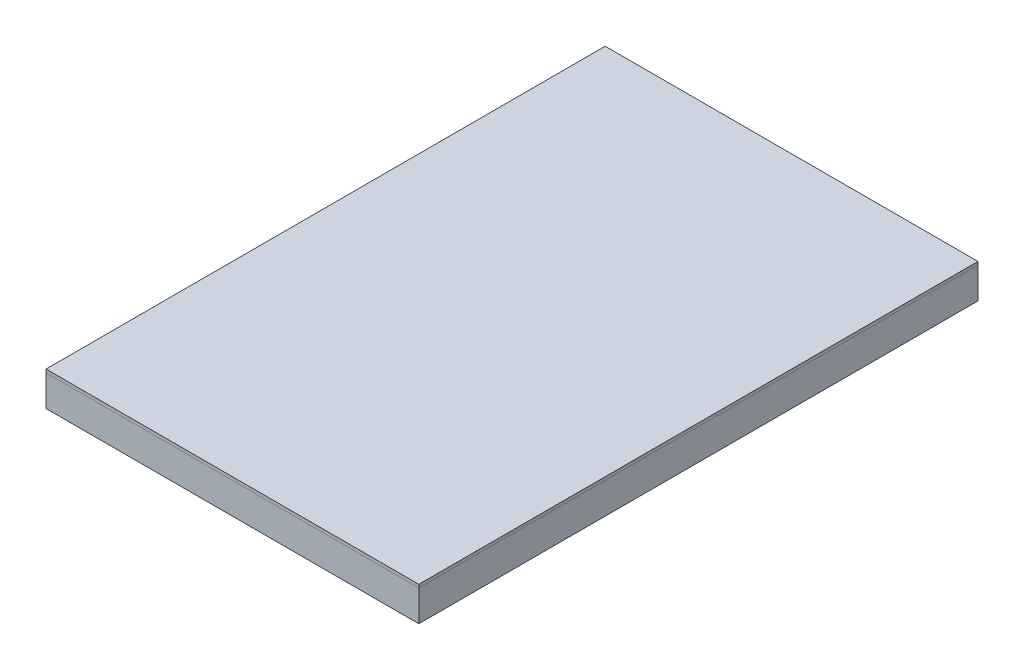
ISO-10303-21;
HEADER;
FILE_DESCRIPTION(('STEP AP214'),'2;1');
FILE_NAME('part.step','',(''),(''),'','','');
FILE_SCHEMA(('AUTOMOTIVE_DESIGN { 1 0 10303 214 1 1 1 1 }'));
ENDSEC;
DATA;
#1=APPLICATION_CONTEXT('core data for automotive mechanical design processes');
#2=APPLICATION_PROTOCOL_DEFINITION('international standard','automotive_design',2000,#1);
#3=PRODUCT_CONTEXT('',#1,'mechanical');
#4=PRODUCT('Part','Part','',(#3));
#5=PRODUCT_RELATED_PRODUCT_CATEGORY('part','',(#4));
#6=PRODUCT_DEFINITION_FORMATION('','',#4);
#7=PRODUCT_DEFINITION_CONTEXT('part definition',#1,'design');
#8=PRODUCT_DEFINITION('design','',#6,#7);
#9=PRODUCT_DEFINITION_SHAPE('','',#8);
#10=(LENGTH_UNIT() NAMED_UNIT(*) SI_UNIT(.MILLI.,.METRE.));
#11=(NAMED_UNIT(*) PLANE_ANGLE_UNIT() SI_UNIT($,.RADIAN.));
#12=(NAMED_UNIT(*) SI_UNIT($,.STERADIAN.) SOLID_ANGLE_UNIT());
#13=UNCERTAINTY_MEASURE_WITH_UNIT(LENGTH_MEASURE(1.E-05),#10,'distance_accuracy_value','');
#14=(GEOMETRIC_REPRESENTATION_CONTEXT(3) GLOBAL_UNCERTAINTY_ASSIGNED_CONTEXT((#13)) GLOBAL_UNIT_ASSIGNED_CONTEXT((#10,
#11,#12)) REPRESENTATION_CONTEXT('',''));
#15=CARTESIAN_POINT('',(0.,0.,0.));
#16=DIRECTION('',(0.,0.,1.));
#17=DIRECTION('',(1.,0.,0.));
#18=AXIS2_PLACEMENT_3D('',#15,#16,#17);
#19=CARTESIAN_POINT('',(-152.4,-25.4,-228.6));
#20=DIRECTION('',(-1.,0.,0.));
#21=DIRECTION('',(0.,0.,1.));
#22=AXIS2_PLACEMENT_3D('',#19,#20,#21);
#23=PLANE('',#22);
#24=DIRECTION('',(0.,0.,1.));
#25=VECTOR('',#24,1.);
#26=CARTESIAN_POINT('',(-152.4,0.,-228.6));
#27=LINE('',#26,#25);
#28=CARTESIAN_POINT('',(-152.4,0.,-228.6));
#29=VERTEX_POINT('',#28);
#30=CARTESIAN_POINT('',(-152.4,0.,228.6));
#31=VERTEX_POINT('',#30);
#32=EDGE_CURVE('E163',#29,#31,#27,.T.);
#33=ORIENTED_EDGE('',*,*,#32,.F.);
#34=DIRECTION('',(0.,1.,0.));
#35=VECTOR('',#34,1.);
#36=CARTESIAN_POINT('',(-152.4,-25.4,-228.6));
#37=LINE('',#36,#35);
#38=CARTESIAN_POINT('',(-152.4,-25.4,-228.6));
#39=VERTEX_POINT('',#38);
#40=EDGE_CURVE('E13',#39,#29,#37,.T.);
#41=ORIENTED_EDGE('',*,*,#40,.F.);
#42=DIRECTION('',(0.,0.,1.));
#43=VECTOR('',#42,1.);
#44=CARTESIAN_POINT('',(-152.4,-25.4,-228.6));
#45=LINE('',#44,#43);
#46=CARTESIAN_POINT('',(-152.4,-25.4,228.6));
#47=VERTEX_POINT('',#46);
#48=EDGE_CURVE('E167',#39,#47,#45,.T.);
#49=ORIENTED_EDGE('',*,*,#48,.T.);
#50=DIRECTION('',(0.,1.,0.));
#51=VECTOR('',#50,1.);
#52=CARTESIAN_POINT('',(-152.4,-25.4,228.6));
#53=LINE('',#52,#51);
#54=EDGE_CURVE('E68',#47,#31,#53,.T.);
#55=ORIENTED_EDGE('',*,*,#54,.T.);
#56=EDGE_LOOP('',(#33,#41,#49,#55));
#57=FACE_BOUND('',#56,.T.);
#58=ADVANCED_FACE('F65',(#57),#23,.T.);
#59=CARTESIAN_POINT('',(-152.4,-25.4,-228.6));
#60=DIRECTION('',(0.,0.,-1.));
#61=DIRECTION('',(-1.,0.,0.));
#62=AXIS2_PLACEMENT_3D('',#59,#60,#61);
#63=PLANE('',#62);
#64=DIRECTION('',(-1.,0.,0.));
#65=VECTOR('',#64,1.);
#66=CARTESIAN_POINT('',(-152.4,0.,-228.6));
#67=LINE('',#66,#65);
#68=CARTESIAN_POINT('',(152.4,0.,-228.6));
#69=VERTEX_POINT('',#68);
#70=EDGE_CURVE('E171',#69,#29,#67,.T.);
#71=ORIENTED_EDGE('',*,*,#70,.F.);
#72=DIRECTION('',(0.,1.,0.));
#73=VECTOR('',#72,1.);
#74=CARTESIAN_POINT('',(152.4,-25.4,-228.6));
#75=LINE('',#74,#73);
#76=CARTESIAN_POINT('',(152.4,-25.4,-228.6));
#77=VERTEX_POINT('',#76);
#78=EDGE_CURVE('E73',#77,#69,#75,.T.);
#79=ORIENTED_EDGE('',*,*,#78,.F.);
#80=DIRECTION('',(-1.,0.,0.));
#81=VECTOR('',#80,1.);
#82=CARTESIAN_POINT('',(-152.4,-25.4,-228.6));
#83=LINE('',#82,#81);
#84=EDGE_CURVE('E177',#77,#39,#83,.T.);
#85=ORIENTED_EDGE('',*,*,#84,.T.);
#86=ORIENTED_EDGE('',*,*,#40,.T.);
#87=EDGE_LOOP('',(#71,#79,#85,#86));
#88=FACE_BOUND('',#87,.T.);
#89=ADVANCED_FACE('F203',(#88),#63,.T.);
#90=CARTESIAN_POINT('',(152.4,-25.4,-228.6));
#91=DIRECTION('',(1.,0.,0.));
#92=DIRECTION('',(0.,0.,-1.));
#93=AXIS2_PLACEMENT_3D('',#90,#91,#92);
#94=PLANE('',#93);
#95=DIRECTION('',(0.,0.,-1.));
#96=VECTOR('',#95,1.);
#97=CARTESIAN_POINT('',(152.4,0.,-228.6));
#98=LINE('',#97,#96);
#99=CARTESIAN_POINT('',(152.4,0.,228.6));
#100=VERTEX_POINT('',#99);
#101=EDGE_CURVE('E185',#100,#69,#98,.T.);
#102=ORIENTED_EDGE('',*,*,#101,.F.);
#103=DIRECTION('',(0.,1.,0.));
#104=VECTOR('',#103,1.);
#105=CARTESIAN_POINT('',(152.4,-25.4,228.6));
#106=LINE('',#105,#104);
#107=CARTESIAN_POINT('',(152.4,-25.4,228.6));
#108=VERTEX_POINT('',#107);
#109=EDGE_CURVE('E190',#108,#100,#106,.T.);
#110=ORIENTED_EDGE('',*,*,#109,.F.);
#111=DIRECTION('',(0.,0.,-1.));
#112=VECTOR('',#111,1.);
#113=CARTESIAN_POINT('',(152.4,-25.4,-228.6));
#114=LINE('',#113,#112);
#115=EDGE_CURVE('E174',#108,#77,#114,.T.);
#116=ORIENTED_EDGE('',*,*,#115,.T.);
#117=ORIENTED_EDGE('',*,*,#78,.T.);
#118=EDGE_LOOP('',(#102,#110,#116,#117));
#119=FACE_BOUND('',#118,.T.);
#120=ADVANCED_FACE('F207',(#119),#94,.T.);
#121=CARTESIAN_POINT('',(-152.4,-25.4,228.6));
#122=DIRECTION('',(0.,0.,1.));
#123=DIRECTION('',(1.,0.,0.));
#124=AXIS2_PLACEMENT_3D('',#121,#122,#123);
#125=PLANE('',#124);
#126=DIRECTION('',(1.,0.,0.));
#127=VECTOR('',#126,1.);
#128=CARTESIAN_POINT('',(-152.4,0.,228.6));
#129=LINE('',#128,#127);
#130=EDGE_CURVE('E182',#31,#100,#129,.T.);
#131=ORIENTED_EDGE('',*,*,#130,.F.);
#132=ORIENTED_EDGE('',*,*,#54,.F.);
#133=DIRECTION('',(1.,0.,0.));
#134=VECTOR('',#133,1.);
#135=CARTESIAN_POINT('',(-152.4,-25.4,228.6));
#136=LINE('',#135,#134);
#137=EDGE_CURVE('E170',#47,#108,#136,.T.);
#138=ORIENTED_EDGE('',*,*,#137,.T.);
#139=ORIENTED_EDGE('',*,*,#109,.T.);
#140=EDGE_LOOP('',(#131,#132,#138,#139));
#141=FACE_BOUND('',#140,.T.);
#142=ADVANCED_FACE('F198',(#141),#125,.T.);
#143=CARTESIAN_POINT('',(-152.4,-25.4,228.6));
#144=DIRECTION('',(0.,1.,0.));
#145=DIRECTION('',(0.,0.,1.));
#146=AXIS2_PLACEMENT_3D('',#143,#144,#145);
#147=PLANE('',#146);
#148=DIRECTION('',(-1.,0.,0.));
#149=VECTOR('',#148,1.);
#150=CARTESIAN_POINT('',(-152.4,-25.4,-203.2));
#151=LINE('',#150,#149);
#152=CARTESIAN_POINT('',(127.,-25.4,-203.2));
#153=VERTEX_POINT('',#152);
#154=CARTESIAN_POINT('',(-127.,-25.4,-203.2));
#155=VERTEX_POINT('',#154);
#156=EDGE_CURVE('E138',#153,#155,#151,.T.);
#157=ORIENTED_EDGE('',*,*,#156,.T.);
#158=DIRECTION('',(0.,0.,1.));
#159=VECTOR('',#158,1.);
#160=CARTESIAN_POINT('',(-127.,-25.4,-228.6));
#161=LINE('',#160,#159);
#162=CARTESIAN_POINT('',(-127.,-25.4,203.2));
#163=VERTEX_POINT('',#162);
#164=EDGE_CURVE('E132',#155,#163,#161,.T.);
#165=ORIENTED_EDGE('',*,*,#164,.T.);
#166=DIRECTION('',(1.,0.,0.));
#167=VECTOR('',#166,1.);
#168=CARTESIAN_POINT('',(-152.4,-25.4,203.2));
#169=LINE('',#168,#167);
#170=CARTESIAN_POINT('',(127.,-25.4,203.2));
#171=VERTEX_POINT('',#170);
#172=EDGE_CURVE('E141',#163,#171,#169,.T.);
#173=ORIENTED_EDGE('',*,*,#172,.T.);
#174=DIRECTION('',(0.,0.,-1.));
#175=VECTOR('',#174,1.);
#176=CARTESIAN_POINT('',(127.,-25.4,-228.6));
#177=LINE('',#176,#175);
#178=EDGE_CURVE('E81',#171,#153,#177,.T.);
#179=ORIENTED_EDGE('',*,*,#178,.T.);
#180=EDGE_LOOP('',(#157,#165,#173,#179));
#181=FACE_BOUND('',#180,.T.);
#182=ORIENTED_EDGE('',*,*,#48,.F.);
#183=ORIENTED_EDGE('',*,*,#84,.F.);
#184=ORIENTED_EDGE('',*,*,#115,.F.);
#185=ORIENTED_EDGE('',*,*,#137,.F.);
#186=EDGE_LOOP('',(#182,#183,#184,#185));
#187=FACE_BOUND('',#186,.T.);
#188=ADVANCED_FACE('F145',(#181,#187),#147,.F.);
#189=CARTESIAN_POINT('',(-152.4,0.,228.6));
#190=DIRECTION('',(0.,1.,0.));
#191=DIRECTION('',(0.,0.,1.));
#192=AXIS2_PLACEMENT_3D('',#189,#190,#191);
#193=PLANE('',#192);
#194=DIRECTION('',(0.,0.,1.));
#195=VECTOR('',#194,1.);
#196=CARTESIAN_POINT('',(-127.,0.,-228.6));
#197=LINE('',#196,#195);
#198=CARTESIAN_POINT('',(-127.,0.,-203.2));
#199=VERTEX_POINT('',#198);
#200=CARTESIAN_POINT('',(-127.,0.,203.2));
#201=VERTEX_POINT('',#200);
#202=EDGE_CURVE('E89',#199,#201,#197,.T.);
#203=ORIENTED_EDGE('',*,*,#202,.F.);
#204=DIRECTION('',(-1.,0.,0.));
#205=VECTOR('',#204,1.);
#206=CARTESIAN_POINT('',(-152.4,0.,-203.2));
#207=LINE('',#206,#205);
#208=CARTESIAN_POINT('',(127.,0.,-203.2));
#209=VERTEX_POINT('',#208);
#210=EDGE_CURVE('E148',#209,#199,#207,.T.);
#211=ORIENTED_EDGE('',*,*,#210,.F.);
#212=DIRECTION('',(0.,0.,-1.));
#213=VECTOR('',#212,1.);
#214=CARTESIAN_POINT('',(127.,0.,-228.6));
#215=LINE('',#214,#213);
#216=CARTESIAN_POINT('',(127.,0.,203.2));
#217=VERTEX_POINT('',#216);
#218=EDGE_CURVE('E151',#217,#209,#215,.T.);
#219=ORIENTED_EDGE('',*,*,#218,.F.);
#220=DIRECTION('',(1.,0.,0.));
#221=VECTOR('',#220,1.);
#222=CARTESIAN_POINT('',(-152.4,0.,203.2));
#223=LINE('',#222,#221);
#224=EDGE_CURVE('E157',#201,#217,#223,.T.);
#225=ORIENTED_EDGE('',*,*,#224,.F.);
#226=EDGE_LOOP('',(#203,#211,#219,#225));
#227=FACE_BOUND('',#226,.T.);
#228=ORIENTED_EDGE('',*,*,#32,.T.);
#229=ORIENTED_EDGE('',*,*,#130,.T.);
#230=ORIENTED_EDGE('',*,*,#101,.T.);
#231=ORIENTED_EDGE('',*,*,#70,.T.);
#232=EDGE_LOOP('',(#228,#229,#230,#231));
#233=FACE_BOUND('',#232,.T.);
#234=ADVANCED_FACE('F200',(#227,#233),#193,.T.);
#235=CARTESIAN_POINT('',(-127.,-25.4,-228.6));
#236=DIRECTION('',(-1.,0.,0.));
#237=DIRECTION('',(0.,0.,1.));
#238=AXIS2_PLACEMENT_3D('',#235,#236,#237);
#239=PLANE('',#238);
#240=ORIENTED_EDGE('',*,*,#202,.T.);
#241=DIRECTION('',(0.,1.,0.));
#242=VECTOR('',#241,1.);
#243=CARTESIAN_POINT('',(-127.,-25.4,203.2));
#244=LINE('',#243,#242);
#245=EDGE_CURVE('E128',#163,#201,#244,.T.);
#246=ORIENTED_EDGE('',*,*,#245,.F.);
#247=ORIENTED_EDGE('',*,*,#164,.F.);
#248=DIRECTION('',(0.,1.,0.));
#249=VECTOR('',#248,1.);
#250=CARTESIAN_POINT('',(-127.,-25.4,-203.2));
#251=LINE('',#250,#249);
#252=EDGE_CURVE('E161',#155,#199,#251,.T.);
#253=ORIENTED_EDGE('',*,*,#252,.T.);
#254=EDGE_LOOP('',(#240,#246,#247,#253));
#255=FACE_BOUND('',#254,.T.);
#256=ADVANCED_FACE('F130',(#255),#239,.F.);
#257=CARTESIAN_POINT('',(-152.4,-25.4,-203.2));
#258=DIRECTION('',(0.,0.,-1.));
#259=DIRECTION('',(-1.,0.,0.));
#260=AXIS2_PLACEMENT_3D('',#257,#258,#259);
#261=PLANE('',#260);
#262=ORIENTED_EDGE('',*,*,#210,.T.);
#263=ORIENTED_EDGE('',*,*,#252,.F.);
#264=ORIENTED_EDGE('',*,*,#156,.F.);
#265=DIRECTION('',(0.,1.,0.));
#266=VECTOR('',#265,1.);
#267=CARTESIAN_POINT('',(127.,-25.4,-203.2));
#268=LINE('',#267,#266);
#269=EDGE_CURVE('E164',#153,#209,#268,.T.);
#270=ORIENTED_EDGE('',*,*,#269,.T.);
#271=EDGE_LOOP('',(#262,#263,#264,#270));
#272=FACE_BOUND('',#271,.T.);
#273=ADVANCED_FACE('F258',(#272),#261,.F.);
#274=CARTESIAN_POINT('',(127.,-25.4,-228.6));
#275=DIRECTION('',(1.,0.,0.));
#276=DIRECTION('',(0.,0.,-1.));
#277=AXIS2_PLACEMENT_3D('',#274,#275,#276);
#278=PLANE('',#277);
#279=ORIENTED_EDGE('',*,*,#218,.T.);
#280=ORIENTED_EDGE('',*,*,#269,.F.);
#281=ORIENTED_EDGE('',*,*,#178,.F.);
#282=DIRECTION('',(0.,1.,0.));
#283=VECTOR('',#282,1.);
#284=CARTESIAN_POINT('',(127.,-25.4,203.2));
#285=LINE('',#284,#283);
#286=EDGE_CURVE('E137',#171,#217,#285,.T.);
#287=ORIENTED_EDGE('',*,*,#286,.T.);
#288=EDGE_LOOP('',(#279,#280,#281,#287));
#289=FACE_BOUND('',#288,.T.);
#290=ADVANCED_FACE('F267',(#289),#278,.F.);
#291=CARTESIAN_POINT('',(-152.4,-25.4,203.2));
#292=DIRECTION('',(0.,0.,1.));
#293=DIRECTION('',(1.,0.,0.));
#294=AXIS2_PLACEMENT_3D('',#291,#292,#293);
#295=PLANE('',#294);
#296=ORIENTED_EDGE('',*,*,#224,.T.);
#297=ORIENTED_EDGE('',*,*,#286,.F.);
#298=ORIENTED_EDGE('',*,*,#172,.F.);
#299=ORIENTED_EDGE('',*,*,#245,.T.);
#300=EDGE_LOOP('',(#296,#297,#298,#299));
#301=FACE_BOUND('',#300,.T.);
#302=ADVANCED_FACE('F142',(#301),#295,.F.);
#303=CLOSED_SHELL('',(#58,#89,#120,#142,#188,#234,#256,#273,#290,#302));
#304=MANIFOLD_SOLID_BREP('B2',#303);
#305=CARTESIAN_POINT('',(-152.4,2.54,-228.6));
#306=DIRECTION('',(1.,0.,0.));
#307=DIRECTION('',(0.,0.,-1.));
#308=AXIS2_PLACEMENT_3D('',#305,#306,#307);
#309=PLANE('',#308);
#310=DIRECTION('',(0.,0.,1.));
#311=VECTOR('',#310,1.);
#312=CARTESIAN_POINT('',(-152.4,0.,-228.6));
#313=LINE('',#312,#311);
#314=CARTESIAN_POINT('',(-152.4,0.,-228.6));
#315=VERTEX_POINT('',#314);
#316=CARTESIAN_POINT('',(-152.4,0.,228.6));
#317=VERTEX_POINT('',#316);
#318=EDGE_CURVE('E358',#315,#317,#313,.T.);
#319=ORIENTED_EDGE('',*,*,#318,.T.);
#320=DIRECTION('',(0.,-1.,0.));
#321=VECTOR('',#320,1.);
#322=CARTESIAN_POINT('',(-152.4,2.54,228.6));
#323=LINE('',#322,#321);
#324=CARTESIAN_POINT('',(-152.4,2.54,228.6));
#325=VERTEX_POINT('',#324);
#326=EDGE_CURVE('E63',#325,#317,#323,.T.);
#327=ORIENTED_EDGE('',*,*,#326,.F.);
#328=DIRECTION('',(0.,0.,1.));
#329=VECTOR('',#328,1.);
#330=CARTESIAN_POINT('',(-152.4,2.54,-228.6));
#331=LINE('',#330,#329);
#332=CARTESIAN_POINT('',(-152.4,2.54,-228.6));
#333=VERTEX_POINT('',#332);
#334=EDGE_CURVE('E346',#333,#325,#331,.T.);
#335=ORIENTED_EDGE('',*,*,#334,.F.);
#336=DIRECTION('',(0.,-1.,0.));
#337=VECTOR('',#336,1.);
#338=CARTESIAN_POINT('',(-152.4,2.54,-228.6));
#339=LINE('',#338,#337);
#340=EDGE_CURVE('E354',#333,#315,#339,.T.);
#341=ORIENTED_EDGE('',*,*,#340,.T.);
#342=EDGE_LOOP('',(#319,#327,#335,#341));
#343=FACE_BOUND('',#342,.T.);
#344=ADVANCED_FACE('F295',(#343),#309,.F.);
#345=CARTESIAN_POINT('',(-152.4,2.54,228.6));
#346=DIRECTION('',(0.,0.,-1.));
#347=DIRECTION('',(-1.,0.,0.));
#348=AXIS2_PLACEMENT_3D('',#345,#346,#347);
#349=PLANE('',#348);
#350=DIRECTION('',(1.,0.,0.));
#351=VECTOR('',#350,1.);
#352=CARTESIAN_POINT('',(-152.4,0.,228.6));
#353=LINE('',#352,#351);
#354=CARTESIAN_POINT('',(152.4,0.,228.6));
#355=VERTEX_POINT('',#354);
#356=EDGE_CURVE('E350',#317,#355,#353,.T.);
#357=ORIENTED_EDGE('',*,*,#356,.T.);
#358=DIRECTION('',(0.,-1.,0.));
#359=VECTOR('',#358,1.);
#360=CARTESIAN_POINT('',(152.4,2.54,228.6));
#361=LINE('',#360,#359);
#362=CARTESIAN_POINT('',(152.4,2.54,228.6));
#363=VERTEX_POINT('',#362);
#364=EDGE_CURVE('E303',#363,#355,#361,.T.);
#365=ORIENTED_EDGE('',*,*,#364,.F.);
#366=DIRECTION('',(1.,0.,0.));
#367=VECTOR('',#366,1.);
#368=CARTESIAN_POINT('',(-152.4,2.54,228.6));
#369=LINE('',#368,#367);
#370=EDGE_CURVE('E341',#325,#363,#369,.T.);
#371=ORIENTED_EDGE('',*,*,#370,.F.);
#372=ORIENTED_EDGE('',*,*,#326,.T.);
#373=EDGE_LOOP('',(#357,#365,#371,#372));
#374=FACE_BOUND('',#373,.T.);
#375=ADVANCED_FACE('F349',(#374),#349,.F.);
#376=CARTESIAN_POINT('',(152.4,2.54,-228.6));
#377=DIRECTION('',(-1.,0.,0.));
#378=DIRECTION('',(0.,0.,1.));
#379=AXIS2_PLACEMENT_3D('',#376,#377,#378);
#380=PLANE('',#379);
#381=DIRECTION('',(0.,0.,-1.));
#382=VECTOR('',#381,1.);
#383=CARTESIAN_POINT('',(152.4,0.,-228.6));
#384=LINE('',#383,#382);
#385=CARTESIAN_POINT('',(152.4,0.,-228.6));
#386=VERTEX_POINT('',#385);
#387=EDGE_CURVE('E328',#355,#386,#384,.T.);
#388=ORIENTED_EDGE('',*,*,#387,.T.);
#389=DIRECTION('',(0.,-1.,0.));
#390=VECTOR('',#389,1.);
#391=CARTESIAN_POINT('',(152.4,2.54,-228.6));
#392=LINE('',#391,#390);
#393=CARTESIAN_POINT('',(152.4,2.54,-228.6));
#394=VERTEX_POINT('',#393);
#395=EDGE_CURVE('E351',#394,#386,#392,.T.);
#396=ORIENTED_EDGE('',*,*,#395,.F.);
#397=DIRECTION('',(0.,0.,-1.));
#398=VECTOR('',#397,1.);
#399=CARTESIAN_POINT('',(152.4,2.54,-228.6));
#400=LINE('',#399,#398);
#401=EDGE_CURVE('E344',#363,#394,#400,.T.);
#402=ORIENTED_EDGE('',*,*,#401,.F.);
#403=ORIENTED_EDGE('',*,*,#364,.T.);
#404=EDGE_LOOP('',(#388,#396,#402,#403));
#405=FACE_BOUND('',#404,.T.);
#406=ADVANCED_FACE('F352',(#405),#380,.F.);
#407=CARTESIAN_POINT('',(-152.4,2.54,-228.6));
#408=DIRECTION('',(0.,0.,1.));
#409=DIRECTION('',(1.,0.,0.));
#410=AXIS2_PLACEMENT_3D('',#407,#408,#409);
#411=PLANE('',#410);
#412=DIRECTION('',(-1.,0.,0.));
#413=VECTOR('',#412,1.);
#414=CARTESIAN_POINT('',(-152.4,0.,-228.6));
#415=LINE('',#414,#413);
#416=EDGE_CURVE('E334',#386,#315,#415,.T.);
#417=ORIENTED_EDGE('',*,*,#416,.T.);
#418=ORIENTED_EDGE('',*,*,#340,.F.);
#419=DIRECTION('',(-1.,0.,0.));
#420=VECTOR('',#419,1.);
#421=CARTESIAN_POINT('',(-152.4,2.54,-228.6));
#422=LINE('',#421,#420);
#423=EDGE_CURVE('E311',#394,#333,#422,.T.);
#424=ORIENTED_EDGE('',*,*,#423,.F.);
#425=ORIENTED_EDGE('',*,*,#395,.T.);
#426=EDGE_LOOP('',(#417,#418,#424,#425));
#427=FACE_BOUND('',#426,.T.);
#428=ADVANCED_FACE('F365',(#427),#411,.F.);
#429=CARTESIAN_POINT('',(-152.4,2.54,228.6));
#430=DIRECTION('',(0.,1.,0.));
#431=DIRECTION('',(0.,0.,1.));
#432=AXIS2_PLACEMENT_3D('',#429,#430,#431);
#433=PLANE('',#432);
#434=ORIENTED_EDGE('',*,*,#334,.T.);
#435=ORIENTED_EDGE('',*,*,#370,.T.);
#436=ORIENTED_EDGE('',*,*,#401,.T.);
#437=ORIENTED_EDGE('',*,*,#423,.T.);
#438=EDGE_LOOP('',(#434,#435,#436,#437));
#439=FACE_BOUND('',#438,.T.);
#440=ADVANCED_FACE('F342',(#439),#433,.T.);
#441=CARTESIAN_POINT('',(-152.4,0.,228.6));
#442=DIRECTION('',(0.,1.,0.));
#443=DIRECTION('',(0.,0.,1.));
#444=AXIS2_PLACEMENT_3D('',#441,#442,#443);
#445=PLANE('',#444);
#446=ORIENTED_EDGE('',*,*,#318,.F.);
#447=ORIENTED_EDGE('',*,*,#416,.F.);
#448=ORIENTED_EDGE('',*,*,#387,.F.);
#449=ORIENTED_EDGE('',*,*,#356,.F.);
#450=EDGE_LOOP('',(#446,#447,#448,#449));
#451=FACE_BOUND('',#450,.T.);
#452=ADVANCED_FACE('F368',(#451),#445,.F.);
#453=CLOSED_SHELL('',(#344,#375,#406,#428,#440,#452));
#454=MANIFOLD_SOLID_BREP('B7',#453);
#455=ADVANCED_BREP_SHAPE_REPRESENTATION('',(#18,#304,#454),#14);
#456=SHAPE_DEFINITION_REPRESENTATION(#9,#455);
ENDSEC;
END-ISO-10303-21;
